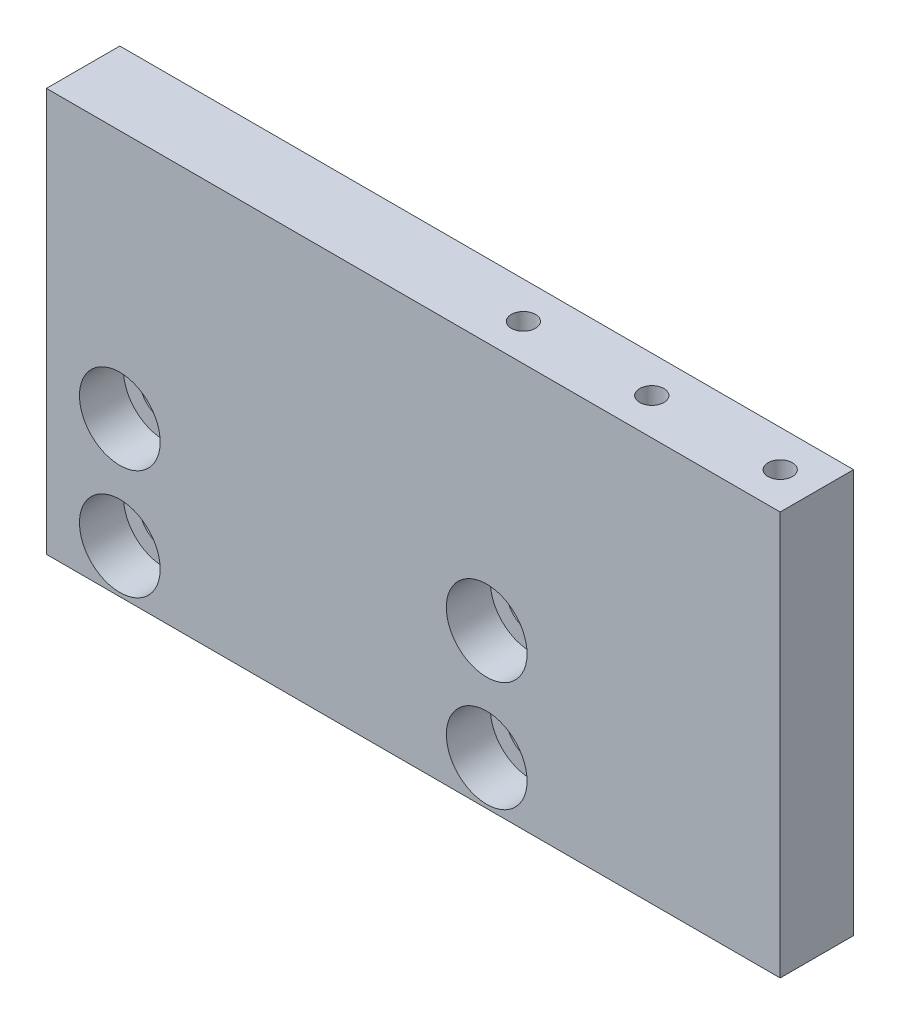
from build123d import *

# Parameters (mm, degrees)
ESQUISSE1_W                                        = 100
ESQUISSE1_H                                        = 55
EXTRUSION1_DEPTH                                   = 10
CHAMBRAGE_POUR_VIS_T_TE_HEXAGONALE_M61_D           = 6.6
CHAMBRAGE_POUR_VIS_T_TE_HEXAGONALE_M61_CBORE_D     = 11
CHAMBRAGE_POUR_VIS_T_TE_HEXAGONALE_M61_CBORE_DEPTH = 6
TROU_TARAUD_M4X0_71_D                              = 3.3
TROU_TARAUD_M4X0_71_DEPTH                          = 10
TROU_TARAUD_M4X0_71_TIP                            = 0.991420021


with BuildPart() as part:
    # Esquisse1 → Extrusion1 (new body)
    with BuildSketch(Plane.XY):
        with Locations((30, 0)):
            Rectangle(ESQUISSE1_W, ESQUISSE1_H)
    extrude(amount=EXTRUSION1_DEPTH)

    # Chambrage pour vis _ t_te hexagonale M61 (through all)
    with Locations(Plane.XY.offset(10)):
        with Locations((40, -21.5), (40, -6.5), (-10, -6.5), (-10, -21.5)):
            CounterBoreHole(CHAMBRAGE_POUR_VIS_T_TE_HEXAGONALE_M61_D / 2, CHAMBRAGE_POUR_VIS_T_TE_HEXAGONALE_M61_CBORE_D / 2, CHAMBRAGE_POUR_VIS_T_TE_HEXAGONALE_M61_CBORE_DEPTH)

    # Trou taraud_ M4x0.71
    with Locations(Plane(origin=(0, 27.5, 0), x_dir=(-1, 0, 0), z_dir=(0, 1, 0))):
        with Locations((-75, 5), (-57.5, 5), (-40, 5)):
            Hole(TROU_TARAUD_M4X0_71_D / 2, depth=TROU_TARAUD_M4X0_71_DEPTH)
            with Locations((0, 0, -(TROU_TARAUD_M4X0_71_DEPTH + TROU_TARAUD_M4X0_71_TIP / 2))):  # 118° drill point
                Cone(0, TROU_TARAUD_M4X0_71_D / 2, TROU_TARAUD_M4X0_71_TIP, mode=Mode.SUBTRACT)


solid = part.part
